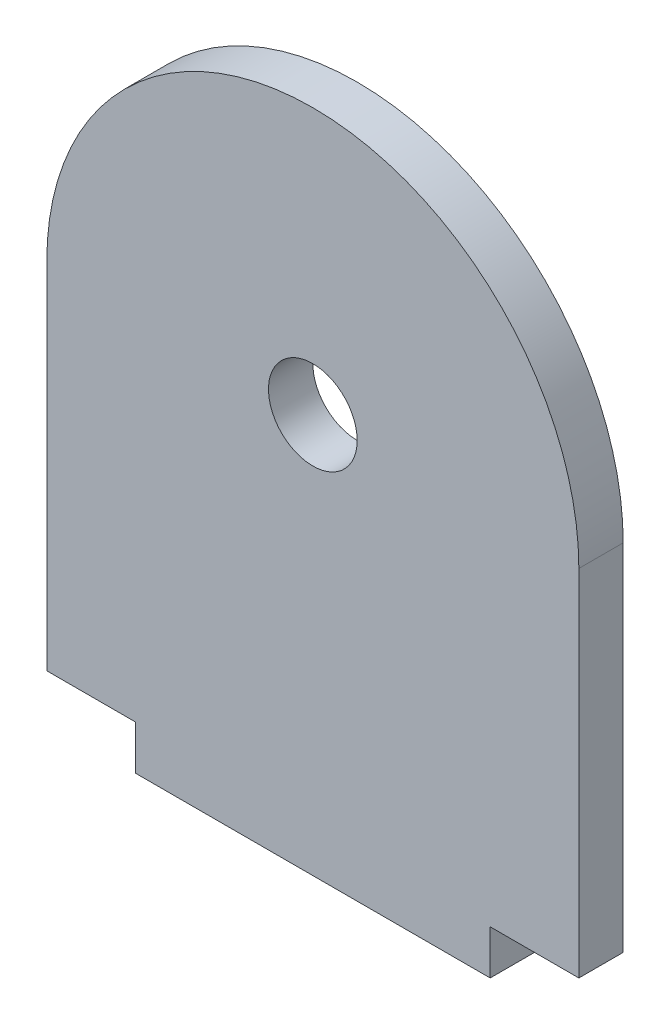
ISO-10303-21;
HEADER;
FILE_DESCRIPTION(('STEP AP214'),'2;1');
FILE_NAME('part.step','',(''),(''),'','','');
FILE_SCHEMA(('AUTOMOTIVE_DESIGN { 1 0 10303 214 1 1 1 1 }'));
ENDSEC;
DATA;
#1=APPLICATION_CONTEXT('core data for automotive mechanical design processes');
#2=APPLICATION_PROTOCOL_DEFINITION('international standard','automotive_design',2000,#1);
#3=PRODUCT_CONTEXT('',#1,'mechanical');
#4=PRODUCT('Part','Part','',(#3));
#5=PRODUCT_RELATED_PRODUCT_CATEGORY('part','',(#4));
#6=PRODUCT_DEFINITION_FORMATION('','',#4);
#7=PRODUCT_DEFINITION_CONTEXT('part definition',#1,'design');
#8=PRODUCT_DEFINITION('design','',#6,#7);
#9=PRODUCT_DEFINITION_SHAPE('','',#8);
#10=(LENGTH_UNIT() NAMED_UNIT(*) SI_UNIT(.MILLI.,.METRE.));
#11=(NAMED_UNIT(*) PLANE_ANGLE_UNIT() SI_UNIT($,.RADIAN.));
#12=(NAMED_UNIT(*) SI_UNIT($,.STERADIAN.) SOLID_ANGLE_UNIT());
#13=UNCERTAINTY_MEASURE_WITH_UNIT(LENGTH_MEASURE(1.E-05),#10,'distance_accuracy_value','');
#14=(GEOMETRIC_REPRESENTATION_CONTEXT(3) GLOBAL_UNCERTAINTY_ASSIGNED_CONTEXT((#13)) GLOBAL_UNIT_ASSIGNED_CONTEXT((#10,
#11,#12)) REPRESENTATION_CONTEXT('',''));
#15=CARTESIAN_POINT('',(0.,0.,0.));
#16=DIRECTION('',(0.,0.,1.));
#17=DIRECTION('',(1.,0.,0.));
#18=AXIS2_PLACEMENT_3D('',#15,#16,#17);
#19=CARTESIAN_POINT('',(-41.1544271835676,19.0605509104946,3.175));
#20=DIRECTION('',(0.,0.,1.));
#21=DIRECTION('',(1.,0.,0.));
#22=AXIS2_PLACEMENT_3D('',#19,#20,#21);
#23=PLANE('',#22);
#24=CARTESIAN_POINT('',(-41.1544271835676,19.0605509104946,3.175));
#25=DIRECTION('',(0.,0.,1.));
#26=DIRECTION('',(1.,0.,0.));
#27=AXIS2_PLACEMENT_3D('',#24,#25,#26);
#28=CIRCLE('',#27,19.05);
#29=CARTESIAN_POINT('',(-22.1044271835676,19.0605509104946,3.175));
#30=VERTEX_POINT('',#29);
#31=CARTESIAN_POINT('',(-60.2044271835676,19.0605509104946,3.175));
#32=VERTEX_POINT('',#31);
#33=EDGE_CURVE('E145',#30,#32,#28,.T.);
#34=ORIENTED_EDGE('',*,*,#33,.T.);
#35=DIRECTION('',(0.,-1.,0.));
#36=VECTOR('',#35,1.);
#37=CARTESIAN_POINT('',(-60.2044271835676,19.0605509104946,3.175));
#38=LINE('',#37,#36);
#39=CARTESIAN_POINT('',(-60.2044271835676,-6.33944908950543,3.175));
#40=VERTEX_POINT('',#39);
#41=EDGE_CURVE('E93',#32,#40,#38,.T.);
#42=ORIENTED_EDGE('',*,*,#41,.T.);
#43=DIRECTION('',(1.,0.,0.));
#44=VECTOR('',#43,1.);
#45=CARTESIAN_POINT('',(-60.2044271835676,-6.33944908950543,3.175));
#46=LINE('',#45,#44);
#47=CARTESIAN_POINT('',(-53.8544271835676,-6.33944908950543,3.175));
#48=VERTEX_POINT('',#47);
#49=EDGE_CURVE('E160',#40,#48,#46,.T.);
#50=ORIENTED_EDGE('',*,*,#49,.T.);
#51=DIRECTION('',(0.,-1.,0.));
#52=VECTOR('',#51,1.);
#53=CARTESIAN_POINT('',(-53.8544271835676,-6.33944908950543,3.175));
#54=LINE('',#53,#52);
#55=CARTESIAN_POINT('',(-53.8544271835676,-9.51444908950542,3.175));
#56=VERTEX_POINT('',#55);
#57=EDGE_CURVE('E173',#48,#56,#54,.T.);
#58=ORIENTED_EDGE('',*,*,#57,.T.);
#59=DIRECTION('',(1.,0.,0.));
#60=VECTOR('',#59,1.);
#61=CARTESIAN_POINT('',(-53.8544271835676,-9.51444908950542,3.175));
#62=LINE('',#61,#60);
#63=CARTESIAN_POINT('',(-28.4544271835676,-9.51444908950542,3.175));
#64=VERTEX_POINT('',#63);
#65=EDGE_CURVE('E112',#56,#64,#62,.T.);
#66=ORIENTED_EDGE('',*,*,#65,.T.);
#67=DIRECTION('',(0.,1.,0.));
#68=VECTOR('',#67,1.);
#69=CARTESIAN_POINT('',(-28.4544271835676,-6.33944908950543,3.175));
#70=LINE('',#69,#68);
#71=CARTESIAN_POINT('',(-28.4544271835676,-6.33944908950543,3.175));
#72=VERTEX_POINT('',#71);
#73=EDGE_CURVE('E106',#64,#72,#70,.T.);
#74=ORIENTED_EDGE('',*,*,#73,.T.);
#75=DIRECTION('',(1.,0.,0.));
#76=VECTOR('',#75,1.);
#77=CARTESIAN_POINT('',(-28.4544271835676,-6.33944908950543,3.175));
#78=LINE('',#77,#76);
#79=CARTESIAN_POINT('',(-22.1044271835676,-6.33944908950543,3.175));
#80=VERTEX_POINT('',#79);
#81=EDGE_CURVE('E110',#72,#80,#78,.T.);
#82=ORIENTED_EDGE('',*,*,#81,.T.);
#83=DIRECTION('',(0.,1.,0.));
#84=VECTOR('',#83,1.);
#85=CARTESIAN_POINT('',(-22.1044271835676,19.0605509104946,3.175));
#86=LINE('',#85,#84);
#87=EDGE_CURVE('E50',#80,#30,#86,.T.);
#88=ORIENTED_EDGE('',*,*,#87,.T.);
#89=EDGE_LOOP('',(#34,#42,#50,#58,#66,#74,#82,#88));
#90=FACE_BOUND('',#89,.T.);
#91=CARTESIAN_POINT('',(-41.1544271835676,19.0605509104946,3.175));
#92=DIRECTION('',(0.,0.,1.));
#93=DIRECTION('',(1.,0.,0.));
#94=AXIS2_PLACEMENT_3D('',#91,#92,#93);
#95=CIRCLE('',#94,3.175);
#96=CARTESIAN_POINT('',(-37.9794271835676,19.0605509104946,3.175));
#97=VERTEX_POINT('',#96);
#98=EDGE_CURVE('E134',#97,#97,#95,.T.);
#99=ORIENTED_EDGE('',*,*,#98,.F.);
#100=EDGE_LOOP('',(#99));
#101=FACE_BOUND('',#100,.T.);
#102=ADVANCED_FACE('F33',(#90,#101),#23,.T.);
#103=CARTESIAN_POINT('',(-41.1544271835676,19.0605509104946,0.));
#104=DIRECTION('',(0.,0.,1.));
#105=DIRECTION('',(1.,0.,0.));
#106=AXIS2_PLACEMENT_3D('',#103,#104,#105);
#107=PLANE('',#106);
#108=CARTESIAN_POINT('',(-41.1544271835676,19.0605509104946,0.));
#109=DIRECTION('',(0.,0.,1.));
#110=DIRECTION('',(1.,0.,0.));
#111=AXIS2_PLACEMENT_3D('',#108,#109,#110);
#112=CIRCLE('',#111,19.05);
#113=CARTESIAN_POINT('',(-22.1044271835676,19.0605509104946,0.));
#114=VERTEX_POINT('',#113);
#115=CARTESIAN_POINT('',(-60.2044271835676,19.0605509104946,0.));
#116=VERTEX_POINT('',#115);
#117=EDGE_CURVE('E130',#114,#116,#112,.T.);
#118=ORIENTED_EDGE('',*,*,#117,.F.);
#119=DIRECTION('',(0.,1.,0.));
#120=VECTOR('',#119,1.);
#121=CARTESIAN_POINT('',(-22.1044271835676,19.0605509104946,0.));
#122=LINE('',#121,#120);
#123=CARTESIAN_POINT('',(-22.1044271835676,-6.33944908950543,0.));
#124=VERTEX_POINT('',#123);
#125=EDGE_CURVE('E85',#124,#114,#122,.T.);
#126=ORIENTED_EDGE('',*,*,#125,.F.);
#127=DIRECTION('',(1.,0.,0.));
#128=VECTOR('',#127,1.);
#129=CARTESIAN_POINT('',(-28.4544271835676,-6.33944908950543,0.));
#130=LINE('',#129,#128);
#131=CARTESIAN_POINT('',(-28.4544271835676,-6.33944908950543,0.));
#132=VERTEX_POINT('',#131);
#133=EDGE_CURVE('E79',#132,#124,#130,.T.);
#134=ORIENTED_EDGE('',*,*,#133,.F.);
#135=DIRECTION('',(0.,1.,0.));
#136=VECTOR('',#135,1.);
#137=CARTESIAN_POINT('',(-28.4544271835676,-6.33944908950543,0.));
#138=LINE('',#137,#136);
#139=CARTESIAN_POINT('',(-28.4544271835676,-9.51444908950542,0.));
#140=VERTEX_POINT('',#139);
#141=EDGE_CURVE('E120',#140,#132,#138,.T.);
#142=ORIENTED_EDGE('',*,*,#141,.F.);
#143=DIRECTION('',(1.,0.,0.));
#144=VECTOR('',#143,1.);
#145=CARTESIAN_POINT('',(-53.8544271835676,-9.51444908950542,0.));
#146=LINE('',#145,#144);
#147=CARTESIAN_POINT('',(-53.8544271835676,-9.51444908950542,0.));
#148=VERTEX_POINT('',#147);
#149=EDGE_CURVE('E140',#148,#140,#146,.T.);
#150=ORIENTED_EDGE('',*,*,#149,.F.);
#151=DIRECTION('',(0.,-1.,0.));
#152=VECTOR('',#151,1.);
#153=CARTESIAN_POINT('',(-53.8544271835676,-6.33944908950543,0.));
#154=LINE('',#153,#152);
#155=CARTESIAN_POINT('',(-53.8544271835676,-6.33944908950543,0.));
#156=VERTEX_POINT('',#155);
#157=EDGE_CURVE('E138',#156,#148,#154,.T.);
#158=ORIENTED_EDGE('',*,*,#157,.F.);
#159=DIRECTION('',(1.,0.,0.));
#160=VECTOR('',#159,1.);
#161=CARTESIAN_POINT('',(-60.2044271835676,-6.33944908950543,0.));
#162=LINE('',#161,#160);
#163=CARTESIAN_POINT('',(-60.2044271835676,-6.33944908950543,0.));
#164=VERTEX_POINT('',#163);
#165=EDGE_CURVE('E136',#164,#156,#162,.T.);
#166=ORIENTED_EDGE('',*,*,#165,.F.);
#167=DIRECTION('',(0.,-1.,0.));
#168=VECTOR('',#167,1.);
#169=CARTESIAN_POINT('',(-60.2044271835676,19.0605509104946,0.));
#170=LINE('',#169,#168);
#171=EDGE_CURVE('E133',#116,#164,#170,.T.);
#172=ORIENTED_EDGE('',*,*,#171,.F.);
#173=EDGE_LOOP('',(#118,#126,#134,#142,#150,#158,#166,#172));
#174=FACE_BOUND('',#173,.T.);
#175=CARTESIAN_POINT('',(-41.1544271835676,19.0605509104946,0.));
#176=DIRECTION('',(0.,0.,1.));
#177=DIRECTION('',(1.,0.,0.));
#178=AXIS2_PLACEMENT_3D('',#175,#176,#177);
#179=CIRCLE('',#178,3.175);
#180=CARTESIAN_POINT('',(-37.9794271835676,19.0605509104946,0.));
#181=VERTEX_POINT('',#180);
#182=EDGE_CURVE('E179',#181,#181,#179,.T.);
#183=ORIENTED_EDGE('',*,*,#182,.T.);
#184=EDGE_LOOP('',(#183));
#185=FACE_BOUND('',#184,.T.);
#186=ADVANCED_FACE('F164',(#174,#185),#107,.F.);
#187=CARTESIAN_POINT('',(-41.1544271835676,19.0605509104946,3.175));
#188=DIRECTION('',(0.,0.,-1.));
#189=DIRECTION('',(-1.,0.,0.));
#190=AXIS2_PLACEMENT_3D('',#187,#188,#189);
#191=CYLINDRICAL_SURFACE('',#190,19.05);
#192=ORIENTED_EDGE('',*,*,#117,.T.);
#193=DIRECTION('',(0.,0.,-1.));
#194=VECTOR('',#193,1.);
#195=CARTESIAN_POINT('',(-60.2044271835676,19.0605509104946,3.175));
#196=LINE('',#195,#194);
#197=EDGE_CURVE('E11',#32,#116,#196,.T.);
#198=ORIENTED_EDGE('',*,*,#197,.F.);
#199=ORIENTED_EDGE('',*,*,#33,.F.);
#200=DIRECTION('',(0.,0.,-1.));
#201=VECTOR('',#200,1.);
#202=CARTESIAN_POINT('',(-22.1044271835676,19.0605509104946,3.175));
#203=LINE('',#202,#201);
#204=EDGE_CURVE('E126',#30,#114,#203,.T.);
#205=ORIENTED_EDGE('',*,*,#204,.T.);
#206=EDGE_LOOP('',(#192,#198,#199,#205));
#207=FACE_BOUND('',#206,.T.);
#208=ADVANCED_FACE('F35',(#207),#191,.T.);
#209=CARTESIAN_POINT('',(-60.2044271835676,19.0605509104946,3.175));
#210=DIRECTION('',(1.,0.,0.));
#211=DIRECTION('',(0.,0.,-1.));
#212=AXIS2_PLACEMENT_3D('',#209,#210,#211);
#213=PLANE('',#212);
#214=ORIENTED_EDGE('',*,*,#171,.T.);
#215=DIRECTION('',(0.,0.,-1.));
#216=VECTOR('',#215,1.);
#217=CARTESIAN_POINT('',(-60.2044271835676,-6.33944908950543,3.175));
#218=LINE('',#217,#216);
#219=EDGE_CURVE('E42',#40,#164,#218,.T.);
#220=ORIENTED_EDGE('',*,*,#219,.F.);
#221=ORIENTED_EDGE('',*,*,#41,.F.);
#222=ORIENTED_EDGE('',*,*,#197,.T.);
#223=EDGE_LOOP('',(#214,#220,#221,#222));
#224=FACE_BOUND('',#223,.T.);
#225=ADVANCED_FACE('F207',(#224),#213,.F.);
#226=CARTESIAN_POINT('',(-60.2044271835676,-6.33944908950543,3.175));
#227=DIRECTION('',(0.,1.,0.));
#228=DIRECTION('',(0.,0.,1.));
#229=AXIS2_PLACEMENT_3D('',#226,#227,#228);
#230=PLANE('',#229);
#231=ORIENTED_EDGE('',*,*,#165,.T.);
#232=DIRECTION('',(0.,0.,-1.));
#233=VECTOR('',#232,1.);
#234=CARTESIAN_POINT('',(-53.8544271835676,-6.33944908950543,3.175));
#235=LINE('',#234,#233);
#236=EDGE_CURVE('E152',#48,#156,#235,.T.);
#237=ORIENTED_EDGE('',*,*,#236,.F.);
#238=ORIENTED_EDGE('',*,*,#49,.F.);
#239=ORIENTED_EDGE('',*,*,#219,.T.);
#240=EDGE_LOOP('',(#231,#237,#238,#239));
#241=FACE_BOUND('',#240,.T.);
#242=ADVANCED_FACE('F158',(#241),#230,.F.);
#243=CARTESIAN_POINT('',(-53.8544271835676,-6.33944908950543,3.175));
#244=DIRECTION('',(1.,0.,0.));
#245=DIRECTION('',(0.,0.,-1.));
#246=AXIS2_PLACEMENT_3D('',#243,#244,#245);
#247=PLANE('',#246);
#248=ORIENTED_EDGE('',*,*,#157,.T.);
#249=DIRECTION('',(0.,0.,-1.));
#250=VECTOR('',#249,1.);
#251=CARTESIAN_POINT('',(-53.8544271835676,-9.51444908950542,3.175));
#252=LINE('',#251,#250);
#253=EDGE_CURVE('E149',#56,#148,#252,.T.);
#254=ORIENTED_EDGE('',*,*,#253,.F.);
#255=ORIENTED_EDGE('',*,*,#57,.F.);
#256=ORIENTED_EDGE('',*,*,#236,.T.);
#257=EDGE_LOOP('',(#248,#254,#255,#256));
#258=FACE_BOUND('',#257,.T.);
#259=ADVANCED_FACE('F169',(#258),#247,.F.);
#260=CARTESIAN_POINT('',(-53.8544271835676,-9.51444908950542,3.175));
#261=DIRECTION('',(0.,1.,0.));
#262=DIRECTION('',(0.,0.,1.));
#263=AXIS2_PLACEMENT_3D('',#260,#261,#262);
#264=PLANE('',#263);
#265=ORIENTED_EDGE('',*,*,#149,.T.);
#266=DIRECTION('',(0.,0.,-1.));
#267=VECTOR('',#266,1.);
#268=CARTESIAN_POINT('',(-28.4544271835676,-9.51444908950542,3.175));
#269=LINE('',#268,#267);
#270=EDGE_CURVE('E121',#64,#140,#269,.T.);
#271=ORIENTED_EDGE('',*,*,#270,.F.);
#272=ORIENTED_EDGE('',*,*,#65,.F.);
#273=ORIENTED_EDGE('',*,*,#253,.T.);
#274=EDGE_LOOP('',(#265,#271,#272,#273));
#275=FACE_BOUND('',#274,.T.);
#276=ADVANCED_FACE('F172',(#275),#264,.F.);
#277=CARTESIAN_POINT('',(-28.4544271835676,-6.33944908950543,3.175));
#278=DIRECTION('',(-1.,0.,0.));
#279=DIRECTION('',(0.,0.,1.));
#280=AXIS2_PLACEMENT_3D('',#277,#278,#279);
#281=PLANE('',#280);
#282=ORIENTED_EDGE('',*,*,#141,.T.);
#283=DIRECTION('',(0.,0.,-1.));
#284=VECTOR('',#283,1.);
#285=CARTESIAN_POINT('',(-28.4544271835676,-6.33944908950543,3.175));
#286=LINE('',#285,#284);
#287=EDGE_CURVE('E117',#72,#132,#286,.T.);
#288=ORIENTED_EDGE('',*,*,#287,.F.);
#289=ORIENTED_EDGE('',*,*,#73,.F.);
#290=ORIENTED_EDGE('',*,*,#270,.T.);
#291=EDGE_LOOP('',(#282,#288,#289,#290));
#292=FACE_BOUND('',#291,.T.);
#293=ADVANCED_FACE('F118',(#292),#281,.F.);
#294=CARTESIAN_POINT('',(-28.4544271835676,-6.33944908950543,3.175));
#295=DIRECTION('',(0.,1.,0.));
#296=DIRECTION('',(0.,0.,1.));
#297=AXIS2_PLACEMENT_3D('',#294,#295,#296);
#298=PLANE('',#297);
#299=ORIENTED_EDGE('',*,*,#133,.T.);
#300=DIRECTION('',(0.,0.,-1.));
#301=VECTOR('',#300,1.);
#302=CARTESIAN_POINT('',(-22.1044271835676,-6.33944908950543,3.175));
#303=LINE('',#302,#301);
#304=EDGE_CURVE('E122',#80,#124,#303,.T.);
#305=ORIENTED_EDGE('',*,*,#304,.F.);
#306=ORIENTED_EDGE('',*,*,#81,.F.);
#307=ORIENTED_EDGE('',*,*,#287,.T.);
#308=EDGE_LOOP('',(#299,#305,#306,#307));
#309=FACE_BOUND('',#308,.T.);
#310=ADVANCED_FACE('F124',(#309),#298,.F.);
#311=CARTESIAN_POINT('',(-22.1044271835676,19.0605509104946,3.175));
#312=DIRECTION('',(-1.,0.,0.));
#313=DIRECTION('',(0.,-1.,0.));
#314=AXIS2_PLACEMENT_3D('',#311,#312,#313);
#315=PLANE('',#314);
#316=ORIENTED_EDGE('',*,*,#125,.T.);
#317=ORIENTED_EDGE('',*,*,#204,.F.);
#318=ORIENTED_EDGE('',*,*,#87,.F.);
#319=ORIENTED_EDGE('',*,*,#304,.T.);
#320=EDGE_LOOP('',(#316,#317,#318,#319));
#321=FACE_BOUND('',#320,.T.);
#322=ADVANCED_FACE('F195',(#321),#315,.F.);
#323=CARTESIAN_POINT('',(-41.1544271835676,19.0605509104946,3.175));
#324=DIRECTION('',(0.,0.,-1.));
#325=DIRECTION('',(-1.,0.,0.));
#326=AXIS2_PLACEMENT_3D('',#323,#324,#325);
#327=CYLINDRICAL_SURFACE('',#326,3.175);
#328=ORIENTED_EDGE('',*,*,#98,.T.);
#329=EDGE_LOOP('',(#328));
#330=FACE_BOUND('',#329,.T.);
#331=ORIENTED_EDGE('',*,*,#182,.F.);
#332=EDGE_LOOP('',(#331));
#333=FACE_BOUND('',#332,.T.);
#334=ADVANCED_FACE('F185',(#330,#333),#327,.F.);
#335=CLOSED_SHELL('',(#102,#186,#208,#225,#242,#259,#276,#293,#310,#322,#334));
#336=MANIFOLD_SOLID_BREP('B2',#335);
#337=ADVANCED_BREP_SHAPE_REPRESENTATION('',(#18,#336),#14);
#338=SHAPE_DEFINITION_REPRESENTATION(#9,#337);
ENDSEC;
END-ISO-10303-21;
